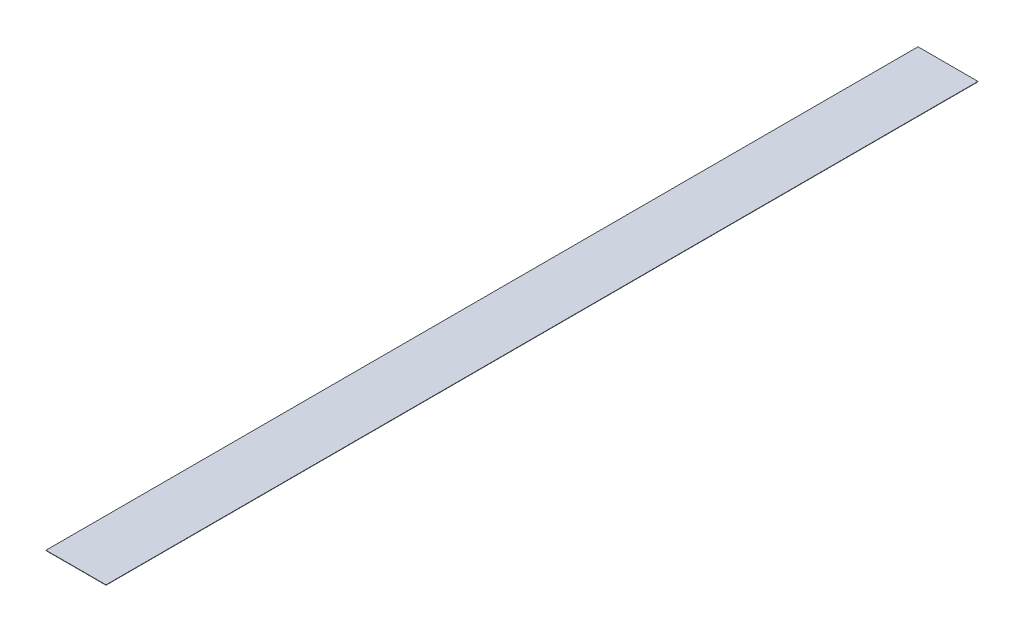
ISO-10303-21;
HEADER;
FILE_DESCRIPTION(('STEP AP214'),'2;1');
FILE_NAME('part.step','',(''),(''),'','','');
FILE_SCHEMA(('AUTOMOTIVE_DESIGN { 1 0 10303 214 1 1 1 1 }'));
ENDSEC;
DATA;
#1=APPLICATION_CONTEXT('core data for automotive mechanical design processes');
#2=APPLICATION_PROTOCOL_DEFINITION('international standard','automotive_design',2000,#1);
#3=PRODUCT_CONTEXT('',#1,'mechanical');
#4=PRODUCT('Part','Part','',(#3));
#5=PRODUCT_RELATED_PRODUCT_CATEGORY('part','',(#4));
#6=PRODUCT_DEFINITION_FORMATION('','',#4);
#7=PRODUCT_DEFINITION_CONTEXT('part definition',#1,'design');
#8=PRODUCT_DEFINITION('design','',#6,#7);
#9=PRODUCT_DEFINITION_SHAPE('','',#8);
#10=(LENGTH_UNIT() NAMED_UNIT(*) SI_UNIT(.MILLI.,.METRE.));
#11=(NAMED_UNIT(*) PLANE_ANGLE_UNIT() SI_UNIT($,.RADIAN.));
#12=(NAMED_UNIT(*) SI_UNIT($,.STERADIAN.) SOLID_ANGLE_UNIT());
#13=UNCERTAINTY_MEASURE_WITH_UNIT(LENGTH_MEASURE(1.E-05),#10,'distance_accuracy_value','');
#14=(GEOMETRIC_REPRESENTATION_CONTEXT(3) GLOBAL_UNCERTAINTY_ASSIGNED_CONTEXT((#13)) GLOBAL_UNIT_ASSIGNED_CONTEXT((#10,
#11,#12)) REPRESENTATION_CONTEXT('',''));
#15=CARTESIAN_POINT('',(0.,0.,0.));
#16=DIRECTION('',(0.,0.,1.));
#17=DIRECTION('',(1.,0.,0.));
#18=AXIS2_PLACEMENT_3D('',#15,#16,#17);
#19=CARTESIAN_POINT('',(0.,0.254,0.));
#20=DIRECTION('',(-1.,0.,0.));
#21=DIRECTION('',(0.,0.,1.));
#22=AXIS2_PLACEMENT_3D('',#19,#20,#21);
#23=PLANE('',#22);
#24=DIRECTION('',(0.,0.,-1.));
#25=VECTOR('',#24,1.);
#26=CARTESIAN_POINT('',(0.,0.,0.));
#27=LINE('',#26,#25);
#28=CARTESIAN_POINT('',(0.,0.,692.15));
#29=VERTEX_POINT('',#28);
#30=CARTESIAN_POINT('',(0.,0.,0.));
#31=VERTEX_POINT('',#30);
#32=EDGE_CURVE('E96',#29,#31,#27,.T.);
#33=ORIENTED_EDGE('',*,*,#32,.T.);
#34=DIRECTION('',(0.,-1.,0.));
#35=VECTOR('',#34,1.);
#36=CARTESIAN_POINT('',(0.,0.254,0.));
#37=LINE('',#36,#35);
#38=CARTESIAN_POINT('',(0.,0.254,0.));
#39=VERTEX_POINT('',#38);
#40=EDGE_CURVE('E11',#39,#31,#37,.T.);
#41=ORIENTED_EDGE('',*,*,#40,.F.);
#42=DIRECTION('',(0.,0.,-1.));
#43=VECTOR('',#42,1.);
#44=CARTESIAN_POINT('',(0.,0.254,0.));
#45=LINE('',#44,#43);
#46=CARTESIAN_POINT('',(0.,0.254,692.15));
#47=VERTEX_POINT('',#46);
#48=EDGE_CURVE('E84',#47,#39,#45,.T.);
#49=ORIENTED_EDGE('',*,*,#48,.F.);
#50=DIRECTION('',(0.,-1.,0.));
#51=VECTOR('',#50,1.);
#52=CARTESIAN_POINT('',(0.,0.254,692.15));
#53=LINE('',#52,#51);
#54=EDGE_CURVE('E92',#47,#29,#53,.T.);
#55=ORIENTED_EDGE('',*,*,#54,.T.);
#56=EDGE_LOOP('',(#33,#41,#49,#55));
#57=FACE_BOUND('',#56,.T.);
#58=ADVANCED_FACE('F33',(#57),#23,.F.);
#59=CARTESIAN_POINT('',(-47.625,0.254,0.));
#60=DIRECTION('',(0.,0.,1.));
#61=DIRECTION('',(1.,0.,0.));
#62=AXIS2_PLACEMENT_3D('',#59,#60,#61);
#63=PLANE('',#62);
#64=DIRECTION('',(-1.,0.,0.));
#65=VECTOR('',#64,1.);
#66=CARTESIAN_POINT('',(-47.625,0.,0.));
#67=LINE('',#66,#65);
#68=CARTESIAN_POINT('',(-47.625,0.,0.));
#69=VERTEX_POINT('',#68);
#70=EDGE_CURVE('E88',#31,#69,#67,.T.);
#71=ORIENTED_EDGE('',*,*,#70,.T.);
#72=DIRECTION('',(0.,-1.,0.));
#73=VECTOR('',#72,1.);
#74=CARTESIAN_POINT('',(-47.625,0.254,0.));
#75=LINE('',#74,#73);
#76=CARTESIAN_POINT('',(-47.625,0.254,0.));
#77=VERTEX_POINT('',#76);
#78=EDGE_CURVE('E41',#77,#69,#75,.T.);
#79=ORIENTED_EDGE('',*,*,#78,.F.);
#80=DIRECTION('',(-1.,0.,0.));
#81=VECTOR('',#80,1.);
#82=CARTESIAN_POINT('',(-47.625,0.254,0.));
#83=LINE('',#82,#81);
#84=EDGE_CURVE('E79',#39,#77,#83,.T.);
#85=ORIENTED_EDGE('',*,*,#84,.F.);
#86=ORIENTED_EDGE('',*,*,#40,.T.);
#87=EDGE_LOOP('',(#71,#79,#85,#86));
#88=FACE_BOUND('',#87,.T.);
#89=ADVANCED_FACE('F87',(#88),#63,.F.);
#90=CARTESIAN_POINT('',(-47.625,0.254,0.));
#91=DIRECTION('',(1.,0.,0.));
#92=DIRECTION('',(0.,0.,-1.));
#93=AXIS2_PLACEMENT_3D('',#90,#91,#92);
#94=PLANE('',#93);
#95=DIRECTION('',(0.,0.,1.));
#96=VECTOR('',#95,1.);
#97=CARTESIAN_POINT('',(-47.625,0.,0.));
#98=LINE('',#97,#96);
#99=CARTESIAN_POINT('',(-47.625,0.,692.15));
#100=VERTEX_POINT('',#99);
#101=EDGE_CURVE('E66',#69,#100,#98,.T.);
#102=ORIENTED_EDGE('',*,*,#101,.T.);
#103=DIRECTION('',(0.,-1.,0.));
#104=VECTOR('',#103,1.);
#105=CARTESIAN_POINT('',(-47.625,0.254,692.15));
#106=LINE('',#105,#104);
#107=CARTESIAN_POINT('',(-47.625,0.254,692.15));
#108=VERTEX_POINT('',#107);
#109=EDGE_CURVE('E89',#108,#100,#106,.T.);
#110=ORIENTED_EDGE('',*,*,#109,.F.);
#111=DIRECTION('',(0.,0.,1.));
#112=VECTOR('',#111,1.);
#113=CARTESIAN_POINT('',(-47.625,0.254,0.));
#114=LINE('',#113,#112);
#115=EDGE_CURVE('E82',#77,#108,#114,.T.);
#116=ORIENTED_EDGE('',*,*,#115,.F.);
#117=ORIENTED_EDGE('',*,*,#78,.T.);
#118=EDGE_LOOP('',(#102,#110,#116,#117));
#119=FACE_BOUND('',#118,.T.);
#120=ADVANCED_FACE('F90',(#119),#94,.F.);
#121=CARTESIAN_POINT('',(0.,0.254,692.15));
#122=DIRECTION('',(0.,0.,-1.));
#123=DIRECTION('',(-1.,0.,0.));
#124=AXIS2_PLACEMENT_3D('',#121,#122,#123);
#125=PLANE('',#124);
#126=DIRECTION('',(1.,0.,0.));
#127=VECTOR('',#126,1.);
#128=CARTESIAN_POINT('',(0.,0.,692.15));
#129=LINE('',#128,#127);
#130=EDGE_CURVE('E72',#100,#29,#129,.T.);
#131=ORIENTED_EDGE('',*,*,#130,.T.);
#132=ORIENTED_EDGE('',*,*,#54,.F.);
#133=DIRECTION('',(1.,0.,0.));
#134=VECTOR('',#133,1.);
#135=CARTESIAN_POINT('',(0.,0.254,692.15));
#136=LINE('',#135,#134);
#137=EDGE_CURVE('E49',#108,#47,#136,.T.);
#138=ORIENTED_EDGE('',*,*,#137,.F.);
#139=ORIENTED_EDGE('',*,*,#109,.T.);
#140=EDGE_LOOP('',(#131,#132,#138,#139));
#141=FACE_BOUND('',#140,.T.);
#142=ADVANCED_FACE('F103',(#141),#125,.F.);
#143=CARTESIAN_POINT('',(0.,0.254,692.15));
#144=DIRECTION('',(0.,-1.,0.));
#145=DIRECTION('',(0.,0.,-1.));
#146=AXIS2_PLACEMENT_3D('',#143,#144,#145);
#147=PLANE('',#146);
#148=ORIENTED_EDGE('',*,*,#48,.T.);
#149=ORIENTED_EDGE('',*,*,#84,.T.);
#150=ORIENTED_EDGE('',*,*,#115,.T.);
#151=ORIENTED_EDGE('',*,*,#137,.T.);
#152=EDGE_LOOP('',(#148,#149,#150,#151));
#153=FACE_BOUND('',#152,.T.);
#154=ADVANCED_FACE('F80',(#153),#147,.F.);
#155=CARTESIAN_POINT('',(0.,0.,692.15));
#156=DIRECTION('',(0.,-1.,0.));
#157=DIRECTION('',(0.,0.,-1.));
#158=AXIS2_PLACEMENT_3D('',#155,#156,#157);
#159=PLANE('',#158);
#160=ORIENTED_EDGE('',*,*,#32,.F.);
#161=ORIENTED_EDGE('',*,*,#130,.F.);
#162=ORIENTED_EDGE('',*,*,#101,.F.);
#163=ORIENTED_EDGE('',*,*,#70,.F.);
#164=EDGE_LOOP('',(#160,#161,#162,#163));
#165=FACE_BOUND('',#164,.T.);
#166=ADVANCED_FACE('F106',(#165),#159,.T.);
#167=CLOSED_SHELL('',(#58,#89,#120,#142,#154,#166));
#168=MANIFOLD_SOLID_BREP('B2',#167);
#169=ADVANCED_BREP_SHAPE_REPRESENTATION('',(#18,#168),#14);
#170=SHAPE_DEFINITION_REPRESENTATION(#9,#169);
ENDSEC;
END-ISO-10303-21;
